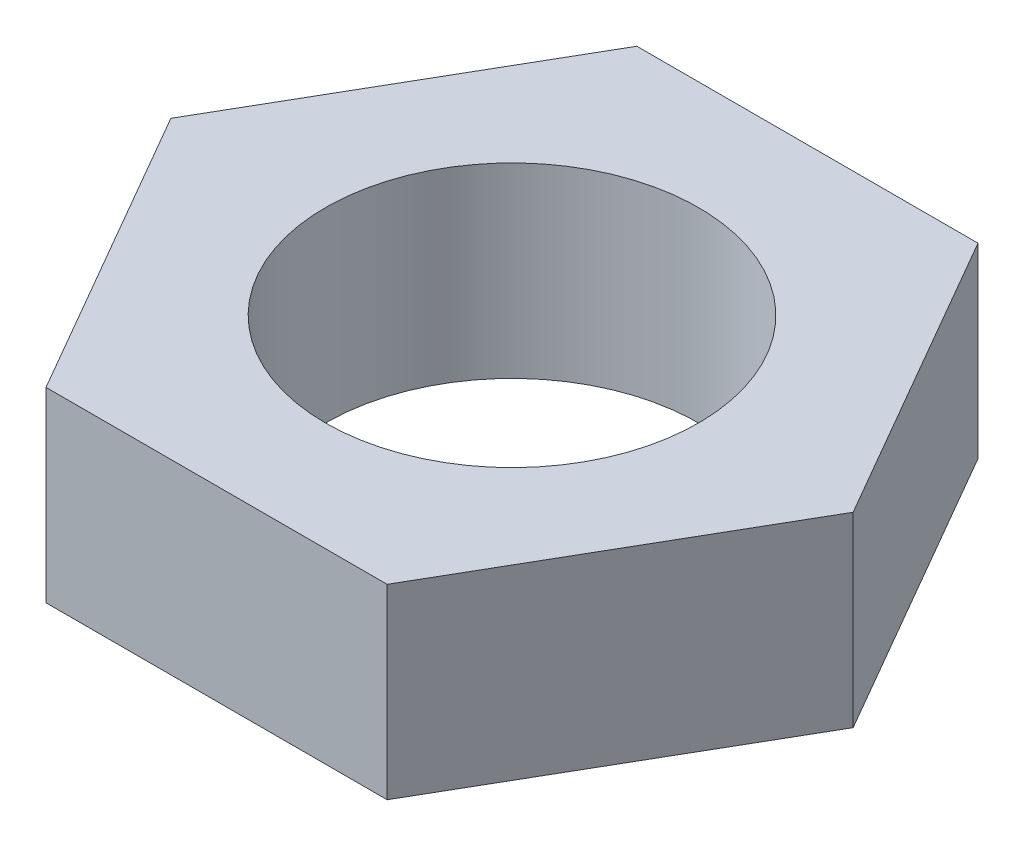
from build123d import *

# Parameters (mm, degrees)
BOSS_EXTRUDE1_DEPTH = 19.05
SKETCH2_R           = 19.05
CUT_EXTRUDE1_DEPTH  = 101.6


with BuildPart() as part:
    # Sketch3 → Boss-Extrude1 (new body)
    with BuildSketch(Plane(origin=(0, 0, 0), x_dir=(1, 0, 0), z_dir=(0, 1, 0))):
        Polygon((17.414327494, -30.1625), (34.828654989, 0), (17.414327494, 30.1625), (-17.414327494, 30.1625), (-34.828654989, 0), (-17.414327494, -30.1625), align=None)
    extrude(amount=BOSS_EXTRUDE1_DEPTH)

    # Sketch2 → Cut-Extrude1 (cut)
    with BuildSketch(Plane(origin=(0, 0, 0), x_dir=(1, 0, 0), z_dir=(0, 1, 0))):
        with Locations(Location((0, 0, 0), (0, 0, 270))):
            Circle(SKETCH2_R)
    extrude(amount=CUT_EXTRUDE1_DEPTH, mode=Mode.SUBTRACT)


solid = part.part
